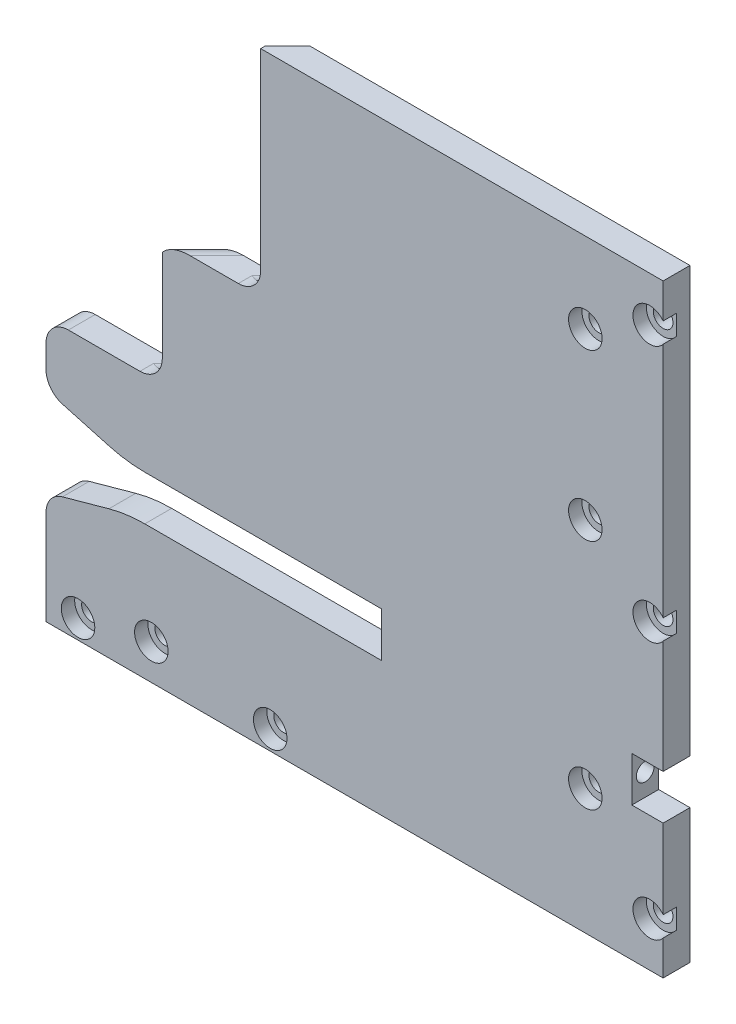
from build123d import *

# Parameters (mm, degrees)
BOSS_EXTRUDE1_DEPTH = 6
CUT_EXTRUDE1_DEPTH  = 194.145023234
SKETCH5_R           = 2
CUT_EXTRUDE2_DEPTH  = 155.550962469
FILLET1_R           = 30
CHAMFER1_SIZE       = 5
FILLET2_R           = 5
SKETCH6_W           = 7
SKETCH6_H           = 10
CUT_EXTRUDE3_DEPTH  = 194.145023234
HOLE1_D             = 4.4
HOLE1_CBORE_D       = 7.5
HOLE1_CBORE_DEPTH   = 3
HOLE2_D             = 4.4
HOLE2_CBORE_D       = 7.5
HOLE2_CBORE_DEPTH   = 3
FILLET3_R           = 5
FILLET5_R           = 5
HOLE3_D             = 4.4
HOLE3_CBORE_D       = 7.5
HOLE3_CBORE_DEPTH   = 3


with BuildPart() as part:
    # Sketch1 → Boss-Extrude1 (new body)
    with BuildSketch(Plane.XY):
        Polygon((0, 0), (-138, 0), (-138, 30), (-63, 30), (-63, 40), (-138, 40), (-138, 59), (-112, 59), (-112, 87), (-90, 87), (-90, 135), (0, 135), align=None)
    extrude(amount=BOSS_EXTRUDE1_DEPTH)

    # Sketch4 → Cut-Extrude1 (cut, through all)
    with BuildSketch(Plane(origin=(0, 0, 0), x_dir=(-1, 0, 0), z_dir=(0, 0, -1))):
        Polygon((120, 40), (138, 45), (138, 40), align=None)
        Polygon((120, 30), (138, 30), (138, 25), align=None)
    extrude(amount=-CUT_EXTRUDE1_DEPTH, mode=Mode.SUBTRACT)

    # Sketch5 → Cut-Extrude2 (cut, through all)
    with BuildSketch(Plane.ZY.offset(63)):
        with Locations((3, 35)):
            Circle(SKETCH5_R)
    extrude(amount=-CUT_EXTRUDE2_DEPTH, mode=Mode.SUBTRACT)

    # Fillet1
    fillet1_edges = [part.edges().sort_by_distance(p)[0] for p in [
        (-120, 40, 3),
        (-120, 30, 3),
    ]]
    fillet(fillet1_edges, radius=FILLET1_R)

    # Chamfer1
    chamfer1_edges = [part.edges().sort_by_distance(p)[0] for p in [
        (-112, 73, 0),
        (-90, 111, 0),
    ]]
    chamfer(chamfer1_edges, length=CHAMFER1_SIZE)

    # Fillet2
    fillet2_edges = [part.edges().sort_by_distance(p)[0] for p in [
        (-138, 59, 3),
        (-138, 45, 3),
        (-138, 25, 3),
    ]]
    fillet(fillet2_edges, radius=FILLET2_R)

    # Sketch6 → Cut-Extrude3 (cut, through all)
    with BuildSketch(Plane.XY.offset(6)):
        with Locations((-3.5, 35)):
            Rectangle(SKETCH6_W, SKETCH6_H)
    extrude(amount=-CUT_EXTRUDE3_DEPTH, mode=Mode.SUBTRACT)

    # Hole1 (through all)
    with Locations(Plane.XY.offset(6)):
        with Locations((-17.4, 117), (-17.4, 80), (-17.4, 28)):
            CounterBoreHole(HOLE1_D / 2, HOLE1_CBORE_D / 2, HOLE1_CBORE_DEPTH)

    # Hole2 (through all)
    with Locations(Plane.XY.offset(6)):
        with Locations((-3, 125), (-3, 67.5), (-3, 10)):
            CounterBoreHole(HOLE2_D / 2, HOLE2_CBORE_D / 2, HOLE2_CBORE_DEPTH)

    # Fillet3
    fillet3_edges = [part.edges().sort_by_distance(p)[0] for p in [
        (-112, 59, 5.5),
        (-90, 87, 5.5),
        (-109.5, 59, 2.5),
        (-87.5, 87, 2.5),
    ]]
    fillet(fillet3_edges, radius=FILLET3_R)

    # Fillet5
    fillet5_edges = [part.edges().sort_by_distance(p)[0] for p in [
        (-109.5, 87, 2.5),
    ]]
    fillet(fillet5_edges, radius=FILLET5_R)

    # Hole3 (through all)
    with Locations(Plane.XY.offset(6)):
        with Locations((-130.844995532, 4.293591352), (-114.451398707, 7.906888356), (-87.870353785, 4.293591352)):
            CounterBoreHole(HOLE3_D / 2, HOLE3_CBORE_D / 2, HOLE3_CBORE_DEPTH)


solid = part.part
